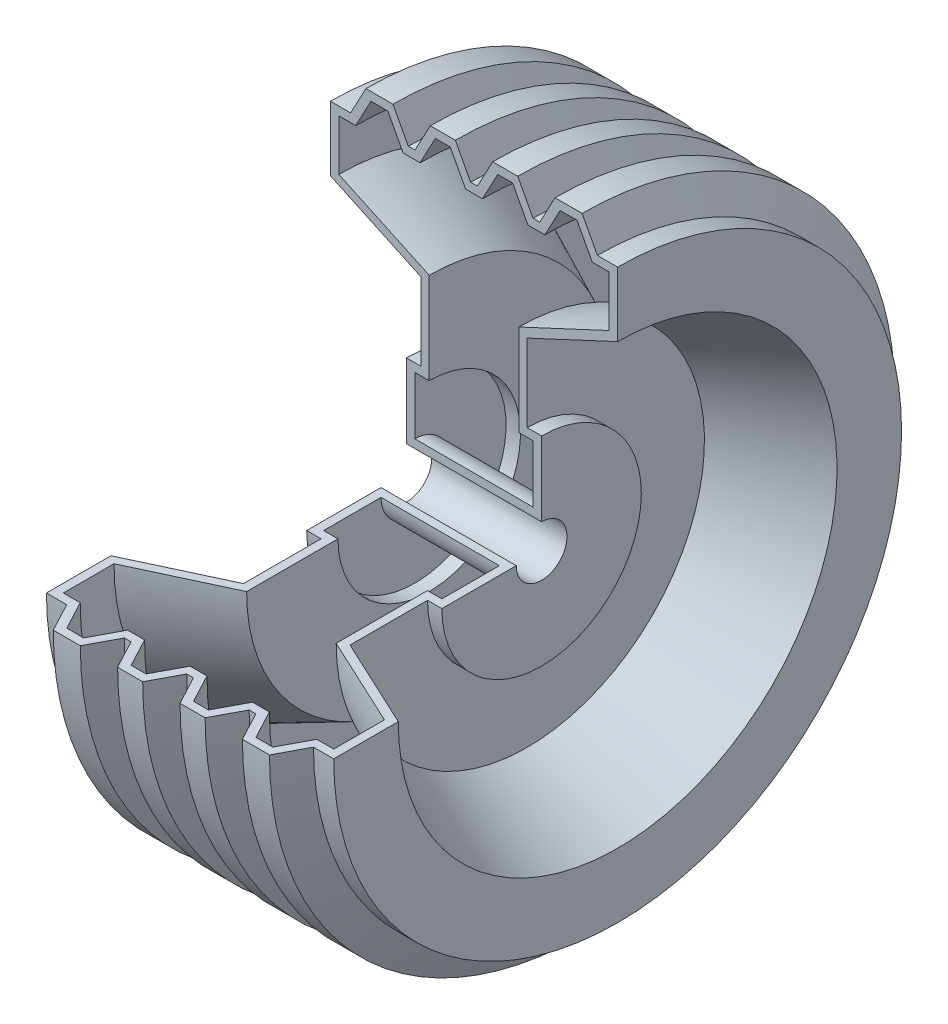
from build123d import *

# Parameters (mm, degrees)
REVOLVE_THIN1_ANGLE = 270


with BuildPart() as part:
    # Sketch1 → Revolve-Thin1 (revolve)
    with BuildSketch(Plane.XY):
        Polygon((-1.995696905, 168), (-11.034757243, 185), (-25.88712208, 185), (-34.926182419, 168), (-38.917576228, 168), (-47.956636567, 185), (-63.965242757, 185), (-73.004303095, 168), (-85, 168), (-85, 129.814648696), (-31.5, 104.867188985), (-31.5, 59), (-40, 59), (-40, 15), (40, 15), (40, 59), (31.5, 59), (31.5, 104.867188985), (85, 129.814648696), (85, 168), (73.004303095, 168), (63.965242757, 185), (47.956636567, 185), (38.917576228, 168), (34.926182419, 168), (25.88712208, 185), (11.034757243, 185), (1.995696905, 168), align=None)
        Polygon((-5, 163), (-14.039060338, 180), (-22.882818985, 180), (-31.921879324, 163), (-41.921879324, 163), (-50.960939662, 180), (-60.960939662, 180), (-70, 163), (-80, 163), (-80, 133), (-26.5, 108.052540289), (-26.5, 54), (-35, 54), (-35, 20), (35, 20), (35, 54), (26.5, 54), (26.5, 108.052540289), (80, 133), (80, 163), (70, 163), (60.960939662, 180), (50.960939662, 180), (41.921879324, 163), (31.921879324, 163), (22.882818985, 180), (14.039060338, 180), (5, 163), align=None, mode=Mode.SUBTRACT)
    revolve(axis=Axis((-56.654652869, 0, 0), (-1, 0, 0)), revolution_arc=REVOLVE_THIN1_ANGLE)


solid = part.part
